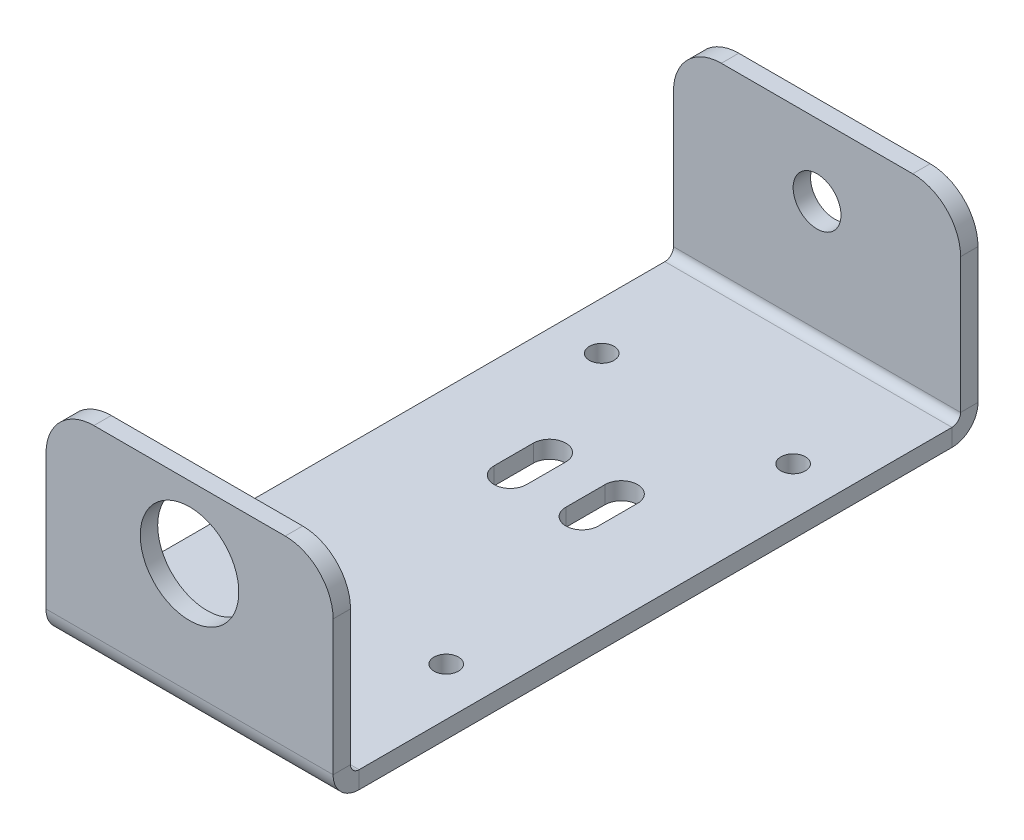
ISO-10303-21;
HEADER;
FILE_DESCRIPTION(('STEP AP214'),'2;1');
FILE_NAME('part.step','',(''),(''),'','','');
FILE_SCHEMA(('AUTOMOTIVE_DESIGN { 1 0 10303 214 1 1 1 1 }'));
ENDSEC;
DATA;
#1=APPLICATION_CONTEXT('core data for automotive mechanical design processes');
#2=APPLICATION_PROTOCOL_DEFINITION('international standard','automotive_design',2000,#1);
#3=PRODUCT_CONTEXT('',#1,'mechanical');
#4=PRODUCT('Part','Part','',(#3));
#5=PRODUCT_RELATED_PRODUCT_CATEGORY('part','',(#4));
#6=PRODUCT_DEFINITION_FORMATION('','',#4);
#7=PRODUCT_DEFINITION_CONTEXT('part definition',#1,'design');
#8=PRODUCT_DEFINITION('design','',#6,#7);
#9=PRODUCT_DEFINITION_SHAPE('','',#8);
#10=(LENGTH_UNIT() NAMED_UNIT(*) SI_UNIT(.MILLI.,.METRE.));
#11=(NAMED_UNIT(*) PLANE_ANGLE_UNIT() SI_UNIT($,.RADIAN.));
#12=(NAMED_UNIT(*) SI_UNIT($,.STERADIAN.) SOLID_ANGLE_UNIT());
#13=UNCERTAINTY_MEASURE_WITH_UNIT(LENGTH_MEASURE(1.E-05),#10,'distance_accuracy_value','');
#14=(GEOMETRIC_REPRESENTATION_CONTEXT(3) GLOBAL_UNCERTAINTY_ASSIGNED_CONTEXT((#13)) GLOBAL_UNIT_ASSIGNED_CONTEXT((#10,
#11,#12)) REPRESENTATION_CONTEXT('',''));
#15=CARTESIAN_POINT('',(0.,0.,0.));
#16=DIRECTION('',(0.,0.,1.));
#17=DIRECTION('',(1.,0.,0.));
#18=AXIS2_PLACEMENT_3D('',#15,#16,#17);
#19=CARTESIAN_POINT('',(19.05,1.143,-80.9625));
#20=DIRECTION('',(1.,0.,0.));
#21=DIRECTION('',(0.,0.,-1.));
#22=AXIS2_PLACEMENT_3D('',#19,#20,#21);
#23=PLANE('',#22);
#24=DIRECTION('',(0.,0.,-1.));
#25=VECTOR('',#24,1.);
#26=CARTESIAN_POINT('',(19.05,1.143,-80.9625));
#27=LINE('',#26,#25);
#28=CARTESIAN_POINT('',(19.05,1.143,-80.9625));
#29=VERTEX_POINT('',#28);
#30=CARTESIAN_POINT('',(19.05,1.143,-83.2739));
#31=VERTEX_POINT('',#30);
#32=EDGE_CURVE('E388',#29,#31,#27,.T.);
#33=ORIENTED_EDGE('',*,*,#32,.F.);
#34=CARTESIAN_POINT('',(19.05,1.143,-79.8195));
#35=DIRECTION('',(1.,0.,0.));
#36=DIRECTION('',(0.,0.,-1.));
#37=AXIS2_PLACEMENT_3D('',#34,#35,#36);
#38=CIRCLE('',#37,1.143);
#39=CARTESIAN_POINT('',(19.05,0.,-79.8195));
#40=VERTEX_POINT('',#39);
#41=EDGE_CURVE('E302',#29,#40,#38,.F.);
#42=ORIENTED_EDGE('',*,*,#41,.T.);
#43=DIRECTION('',(0.,1.,0.));
#44=VECTOR('',#43,1.);
#45=CARTESIAN_POINT('',(19.05,-2.3114,-79.8195));
#46=LINE('',#45,#44);
#47=CARTESIAN_POINT('',(19.05,-2.3114,-79.8195));
#48=VERTEX_POINT('',#47);
#49=EDGE_CURVE('E386',#48,#40,#46,.T.);
#50=ORIENTED_EDGE('',*,*,#49,.F.);
#51=CARTESIAN_POINT('',(19.05,1.143,-79.8195));
#52=DIRECTION('',(1.,0.,0.));
#53=DIRECTION('',(0.,0.,-1.));
#54=AXIS2_PLACEMENT_3D('',#51,#52,#53);
#55=CIRCLE('',#54,3.4544);
#56=EDGE_CURVE('E295',#31,#48,#55,.F.);
#57=ORIENTED_EDGE('',*,*,#56,.F.);
#58=EDGE_LOOP('',(#33,#42,#50,#57));
#59=FACE_BOUND('',#58,.T.);
#60=ADVANCED_FACE('F37',(#59),#23,.T.);
#61=CARTESIAN_POINT('',(19.05,-2.3114,-79.8195));
#62=DIRECTION('',(1.,0.,0.));
#63=DIRECTION('',(0.,0.,-1.));
#64=AXIS2_PLACEMENT_3D('',#61,#62,#63);
#65=PLANE('',#64);
#66=DIRECTION('',(0.,1.,0.));
#67=VECTOR('',#66,1.);
#68=CARTESIAN_POINT('',(19.05,0.,-83.2739));
#69=LINE('',#68,#67);
#70=CARTESIAN_POINT('',(19.05,19.05,-83.2739));
#71=VERTEX_POINT('',#70);
#72=EDGE_CURVE('E298',#71,#31,#69,.F.);
#73=ORIENTED_EDGE('',*,*,#72,.F.);
#74=DIRECTION('',(0.,0.,-1.));
#75=VECTOR('',#74,1.);
#76=CARTESIAN_POINT('',(19.05,19.05,-79.8195));
#77=LINE('',#76,#75);
#78=CARTESIAN_POINT('',(19.05,19.05,-80.9625));
#79=VERTEX_POINT('',#78);
#80=EDGE_CURVE('E400',#71,#79,#77,.F.);
#81=ORIENTED_EDGE('',*,*,#80,.T.);
#82=DIRECTION('',(0.,-1.,0.));
#83=VECTOR('',#82,1.);
#84=CARTESIAN_POINT('',(19.05,0.,-80.9625));
#85=LINE('',#84,#83);
#86=EDGE_CURVE('E300',#79,#29,#85,.T.);
#87=ORIENTED_EDGE('',*,*,#86,.T.);
#88=ORIENTED_EDGE('',*,*,#32,.T.);
#89=EDGE_LOOP('',(#73,#81,#87,#88));
#90=FACE_BOUND('',#89,.T.);
#91=ADVANCED_FACE('F507',(#90),#65,.T.);
#92=CARTESIAN_POINT('',(-19.05,0.,-79.8195));
#93=DIRECTION('',(-1.,0.,0.));
#94=DIRECTION('',(0.,0.,1.));
#95=AXIS2_PLACEMENT_3D('',#92,#93,#94);
#96=PLANE('',#95);
#97=DIRECTION('',(0.,-1.,0.));
#98=VECTOR('',#97,1.);
#99=CARTESIAN_POINT('',(-19.05,0.,-79.8195));
#100=LINE('',#99,#98);
#101=CARTESIAN_POINT('',(-19.05,0.,-79.8195));
#102=VERTEX_POINT('',#101);
#103=CARTESIAN_POINT('',(-19.05,-2.3114,-79.8195));
#104=VERTEX_POINT('',#103);
#105=EDGE_CURVE('E384',#102,#104,#100,.T.);
#106=ORIENTED_EDGE('',*,*,#105,.F.);
#107=CARTESIAN_POINT('',(-19.05,1.143,-79.8195));
#108=DIRECTION('',(1.,0.,0.));
#109=DIRECTION('',(0.,0.,-1.));
#110=AXIS2_PLACEMENT_3D('',#107,#108,#109);
#111=CIRCLE('',#110,1.143);
#112=CARTESIAN_POINT('',(-19.05,1.143,-80.9625));
#113=VERTEX_POINT('',#112);
#114=EDGE_CURVE('E330',#113,#102,#111,.F.);
#115=ORIENTED_EDGE('',*,*,#114,.F.);
#116=DIRECTION('',(0.,0.,1.));
#117=VECTOR('',#116,1.);
#118=CARTESIAN_POINT('',(-19.05,1.143,-83.2739));
#119=LINE('',#118,#117);
#120=CARTESIAN_POINT('',(-19.05,1.143,-83.2739));
#121=VERTEX_POINT('',#120);
#122=EDGE_CURVE('E381',#121,#113,#119,.T.);
#123=ORIENTED_EDGE('',*,*,#122,.F.);
#124=CARTESIAN_POINT('',(-19.05,1.143,-79.8195));
#125=DIRECTION('',(1.,0.,0.));
#126=DIRECTION('',(0.,0.,-1.));
#127=AXIS2_PLACEMENT_3D('',#124,#125,#126);
#128=CIRCLE('',#127,3.4544);
#129=EDGE_CURVE('E323',#121,#104,#128,.F.);
#130=ORIENTED_EDGE('',*,*,#129,.T.);
#131=EDGE_LOOP('',(#106,#115,#123,#130));
#132=FACE_BOUND('',#131,.T.);
#133=ADVANCED_FACE('F473',(#132),#96,.T.);
#134=CARTESIAN_POINT('',(-19.05,1.143,-83.2739));
#135=DIRECTION('',(-1.,0.,0.));
#136=DIRECTION('',(0.,0.,1.));
#137=AXIS2_PLACEMENT_3D('',#134,#135,#136);
#138=PLANE('',#137);
#139=DIRECTION('',(0.,0.,1.));
#140=VECTOR('',#139,1.);
#141=CARTESIAN_POINT('',(-19.05,0.,0.));
#142=LINE('',#141,#140);
#143=CARTESIAN_POINT('',(-19.05,0.,-1.143));
#144=VERTEX_POINT('',#143);
#145=EDGE_CURVE('E333',#102,#144,#142,.T.);
#146=ORIENTED_EDGE('',*,*,#145,.F.);
#147=ORIENTED_EDGE('',*,*,#105,.T.);
#148=DIRECTION('',(0.,0.,-1.));
#149=VECTOR('',#148,1.);
#150=CARTESIAN_POINT('',(-19.05,-2.3114,0.));
#151=LINE('',#150,#149);
#152=CARTESIAN_POINT('',(-19.05,-2.3114,-1.143));
#153=VERTEX_POINT('',#152);
#154=EDGE_CURVE('E320',#104,#153,#151,.F.);
#155=ORIENTED_EDGE('',*,*,#154,.T.);
#156=DIRECTION('',(0.,1.,0.));
#157=VECTOR('',#156,1.);
#158=CARTESIAN_POINT('',(-19.05,-2.3114,-1.143));
#159=LINE('',#158,#157);
#160=EDGE_CURVE('E373',#153,#144,#159,.T.);
#161=ORIENTED_EDGE('',*,*,#160,.T.);
#162=EDGE_LOOP('',(#146,#147,#155,#161));
#163=FACE_BOUND('',#162,.T.);
#164=ADVANCED_FACE('F466',(#163),#138,.T.);
#165=CARTESIAN_POINT('',(19.05,0.,-1.143));
#166=DIRECTION('',(1.,0.,0.));
#167=DIRECTION('',(0.,0.,-1.));
#168=AXIS2_PLACEMENT_3D('',#165,#166,#167);
#169=PLANE('',#168);
#170=DIRECTION('',(0.,-1.,0.));
#171=VECTOR('',#170,1.);
#172=CARTESIAN_POINT('',(19.05,0.,-1.143));
#173=LINE('',#172,#171);
#174=CARTESIAN_POINT('',(19.05,0.,-1.143));
#175=VERTEX_POINT('',#174);
#176=CARTESIAN_POINT('',(19.05,-2.3114,-1.143));
#177=VERTEX_POINT('',#176);
#178=EDGE_CURVE('E379',#175,#177,#173,.T.);
#179=ORIENTED_EDGE('',*,*,#178,.F.);
#180=CARTESIAN_POINT('',(19.05,1.143,-1.143));
#181=DIRECTION('',(1.,0.,0.));
#182=DIRECTION('',(0.,0.,-1.));
#183=AXIS2_PLACEMENT_3D('',#180,#181,#182);
#184=CIRCLE('',#183,1.143);
#185=CARTESIAN_POINT('',(19.05,1.143,0.));
#186=VERTEX_POINT('',#185);
#187=EDGE_CURVE('E308',#175,#186,#184,.F.);
#188=ORIENTED_EDGE('',*,*,#187,.T.);
#189=DIRECTION('',(0.,0.,-1.));
#190=VECTOR('',#189,1.);
#191=CARTESIAN_POINT('',(19.05,1.143,2.3114));
#192=LINE('',#191,#190);
#193=CARTESIAN_POINT('',(19.05,1.143,2.3114));
#194=VERTEX_POINT('',#193);
#195=EDGE_CURVE('E377',#194,#186,#192,.T.);
#196=ORIENTED_EDGE('',*,*,#195,.F.);
#197=CARTESIAN_POINT('',(19.05,1.143,-1.143));
#198=DIRECTION('',(1.,0.,0.));
#199=DIRECTION('',(0.,0.,-1.));
#200=AXIS2_PLACEMENT_3D('',#197,#198,#199);
#201=CIRCLE('',#200,3.4544);
#202=EDGE_CURVE('E289',#177,#194,#201,.F.);
#203=ORIENTED_EDGE('',*,*,#202,.F.);
#204=EDGE_LOOP('',(#179,#188,#196,#203));
#205=FACE_BOUND('',#204,.T.);
#206=ADVANCED_FACE('F452',(#205),#169,.T.);
#207=CARTESIAN_POINT('',(19.05,1.143,2.3114));
#208=DIRECTION('',(1.,0.,0.));
#209=DIRECTION('',(0.,0.,-1.));
#210=AXIS2_PLACEMENT_3D('',#207,#208,#209);
#211=PLANE('',#210);
#212=DIRECTION('',(0.,0.,1.));
#213=VECTOR('',#212,1.);
#214=CARTESIAN_POINT('',(19.05,0.,0.));
#215=LINE('',#214,#213);
#216=EDGE_CURVE('E305',#40,#175,#215,.T.);
#217=ORIENTED_EDGE('',*,*,#216,.T.);
#218=ORIENTED_EDGE('',*,*,#178,.T.);
#219=DIRECTION('',(0.,0.,-1.));
#220=VECTOR('',#219,1.);
#221=CARTESIAN_POINT('',(19.05,-2.3114,0.));
#222=LINE('',#221,#220);
#223=EDGE_CURVE('E292',#48,#177,#222,.F.);
#224=ORIENTED_EDGE('',*,*,#223,.F.);
#225=ORIENTED_EDGE('',*,*,#49,.T.);
#226=EDGE_LOOP('',(#217,#218,#224,#225));
#227=FACE_BOUND('',#226,.T.);
#228=ADVANCED_FACE('F485',(#227),#211,.T.);
#229=CARTESIAN_POINT('',(-19.05,1.143,0.));
#230=DIRECTION('',(-1.,0.,0.));
#231=DIRECTION('',(0.,0.,1.));
#232=AXIS2_PLACEMENT_3D('',#229,#230,#231);
#233=PLANE('',#232);
#234=DIRECTION('',(0.,0.,1.));
#235=VECTOR('',#234,1.);
#236=CARTESIAN_POINT('',(-19.05,1.143,0.));
#237=LINE('',#236,#235);
#238=CARTESIAN_POINT('',(-19.05,1.143,0.));
#239=VERTEX_POINT('',#238);
#240=CARTESIAN_POINT('',(-19.05,1.143,2.3114));
#241=VERTEX_POINT('',#240);
#242=EDGE_CURVE('E375',#239,#241,#237,.T.);
#243=ORIENTED_EDGE('',*,*,#242,.F.);
#244=CARTESIAN_POINT('',(-19.05,1.143,-1.143));
#245=DIRECTION('',(1.,0.,0.));
#246=DIRECTION('',(0.,0.,-1.));
#247=AXIS2_PLACEMENT_3D('',#244,#245,#246);
#248=CIRCLE('',#247,1.143);
#249=EDGE_CURVE('E286',#144,#239,#248,.F.);
#250=ORIENTED_EDGE('',*,*,#249,.F.);
#251=ORIENTED_EDGE('',*,*,#160,.F.);
#252=CARTESIAN_POINT('',(-19.05,1.143,-1.143));
#253=DIRECTION('',(1.,0.,0.));
#254=DIRECTION('',(0.,0.,-1.));
#255=AXIS2_PLACEMENT_3D('',#252,#253,#254);
#256=CIRCLE('',#255,3.4544);
#257=EDGE_CURVE('E317',#153,#241,#256,.F.);
#258=ORIENTED_EDGE('',*,*,#257,.T.);
#259=EDGE_LOOP('',(#243,#250,#251,#258));
#260=FACE_BOUND('',#259,.T.);
#261=ADVANCED_FACE('F458',(#260),#233,.T.);
#262=CARTESIAN_POINT('',(-19.05,-2.3114,-1.143));
#263=DIRECTION('',(-1.,0.,0.));
#264=DIRECTION('',(0.,0.,1.));
#265=AXIS2_PLACEMENT_3D('',#262,#263,#264);
#266=PLANE('',#265);
#267=DIRECTION('',(0.,1.,0.));
#268=VECTOR('',#267,1.);
#269=CARTESIAN_POINT('',(-19.05,0.,2.3114));
#270=LINE('',#269,#268);
#271=CARTESIAN_POINT('',(-19.05,19.05,2.3114));
#272=VERTEX_POINT('',#271);
#273=EDGE_CURVE('E314',#241,#272,#270,.T.);
#274=ORIENTED_EDGE('',*,*,#273,.T.);
#275=DIRECTION('',(0.,0.,-1.));
#276=VECTOR('',#275,1.);
#277=CARTESIAN_POINT('',(-19.05,19.05,-1.143));
#278=LINE('',#277,#276);
#279=CARTESIAN_POINT('',(-19.05,19.05,0.));
#280=VERTEX_POINT('',#279);
#281=EDGE_CURVE('E409',#272,#280,#278,.T.);
#282=ORIENTED_EDGE('',*,*,#281,.T.);
#283=DIRECTION('',(0.,1.,0.));
#284=VECTOR('',#283,1.);
#285=CARTESIAN_POINT('',(-19.05,0.,0.));
#286=LINE('',#285,#284);
#287=EDGE_CURVE('E279',#239,#280,#286,.T.);
#288=ORIENTED_EDGE('',*,*,#287,.F.);
#289=ORIENTED_EDGE('',*,*,#242,.T.);
#290=EDGE_LOOP('',(#274,#282,#288,#289));
#291=FACE_BOUND('',#290,.T.);
#292=ADVANCED_FACE('F432',(#291),#266,.T.);
#293=CARTESIAN_POINT('',(19.05,0.,0.));
#294=DIRECTION('',(0.,0.,1.));
#295=DIRECTION('',(1.,0.,0.));
#296=AXIS2_PLACEMENT_3D('',#293,#294,#295);
#297=PLANE('',#296);
#298=CARTESIAN_POINT('',(0.,15.875,0.));
#299=DIRECTION('',(0.,0.,-1.));
#300=DIRECTION('',(-1.,0.,0.));
#301=AXIS2_PLACEMENT_3D('',#298,#299,#300);
#302=CIRCLE('',#301,6.5405);
#303=CARTESIAN_POINT('',(-6.5405,15.875,0.));
#304=VERTEX_POINT('',#303);
#305=EDGE_CURVE('E263',#304,#304,#302,.T.);
#306=ORIENTED_EDGE('',*,*,#305,.F.);
#307=EDGE_LOOP('',(#306));
#308=FACE_BOUND('',#307,.T.);
#309=ORIENTED_EDGE('',*,*,#287,.T.);
#310=CARTESIAN_POINT('',(-12.7,19.05,0.));
#311=DIRECTION('',(0.,0.,1.));
#312=DIRECTION('',(1.,0.,0.));
#313=AXIS2_PLACEMENT_3D('',#310,#311,#312);
#314=CIRCLE('',#313,6.35);
#315=CARTESIAN_POINT('',(-12.7,25.4,0.));
#316=VERTEX_POINT('',#315);
#317=EDGE_CURVE('E414',#280,#316,#314,.F.);
#318=ORIENTED_EDGE('',*,*,#317,.T.);
#319=DIRECTION('',(-1.,0.,0.));
#320=VECTOR('',#319,1.);
#321=CARTESIAN_POINT('',(19.05,25.4,0.));
#322=LINE('',#321,#320);
#323=CARTESIAN_POINT('',(12.7,25.4,0.));
#324=VERTEX_POINT('',#323);
#325=EDGE_CURVE('E370',#324,#316,#322,.T.);
#326=ORIENTED_EDGE('',*,*,#325,.F.);
#327=CARTESIAN_POINT('',(12.7,19.05,0.));
#328=DIRECTION('',(0.,0.,1.));
#329=DIRECTION('',(1.,0.,0.));
#330=AXIS2_PLACEMENT_3D('',#327,#328,#329);
#331=CIRCLE('',#330,6.35);
#332=CARTESIAN_POINT('',(19.05,19.05,0.));
#333=VERTEX_POINT('',#332);
#334=EDGE_CURVE('E412',#324,#333,#331,.F.);
#335=ORIENTED_EDGE('',*,*,#334,.T.);
#336=DIRECTION('',(0.,1.,0.));
#337=VECTOR('',#336,1.);
#338=CARTESIAN_POINT('',(19.05,0.,0.));
#339=LINE('',#338,#337);
#340=EDGE_CURVE('E282',#186,#333,#339,.T.);
#341=ORIENTED_EDGE('',*,*,#340,.F.);
#342=DIRECTION('',(-1.,0.,0.));
#343=VECTOR('',#342,1.);
#344=CARTESIAN_POINT('',(19.05,1.143,0.));
#345=LINE('',#344,#343);
#346=EDGE_CURVE('E311',#186,#239,#345,.T.);
#347=ORIENTED_EDGE('',*,*,#346,.T.);
#348=EDGE_LOOP('',(#309,#318,#326,#335,#341,#347));
#349=FACE_BOUND('',#348,.T.);
#350=ADVANCED_FACE('F437',(#308,#349),#297,.F.);
#351=CARTESIAN_POINT('',(19.05,25.4,2.3114));
#352=DIRECTION('',(0.,1.,0.));
#353=DIRECTION('',(0.,0.,1.));
#354=AXIS2_PLACEMENT_3D('',#351,#352,#353);
#355=PLANE('',#354);
#356=ORIENTED_EDGE('',*,*,#325,.T.);
#357=DIRECTION('',(0.,0.,-1.));
#358=VECTOR('',#357,1.);
#359=CARTESIAN_POINT('',(-12.7,25.4,2.3114));
#360=LINE('',#359,#358);
#361=CARTESIAN_POINT('',(-12.7,25.4,2.3114));
#362=VERTEX_POINT('',#361);
#363=EDGE_CURVE('E419',#316,#362,#360,.F.);
#364=ORIENTED_EDGE('',*,*,#363,.T.);
#365=DIRECTION('',(-1.,0.,0.));
#366=VECTOR('',#365,1.);
#367=CARTESIAN_POINT('',(19.05,25.4,2.3114));
#368=LINE('',#367,#366);
#369=CARTESIAN_POINT('',(12.7,25.4,2.3114));
#370=VERTEX_POINT('',#369);
#371=EDGE_CURVE('E367',#370,#362,#368,.T.);
#372=ORIENTED_EDGE('',*,*,#371,.F.);
#373=DIRECTION('',(0.,0.,-1.));
#374=VECTOR('',#373,1.);
#375=CARTESIAN_POINT('',(12.7,25.4,2.3114));
#376=LINE('',#375,#374);
#377=EDGE_CURVE('E416',#370,#324,#376,.T.);
#378=ORIENTED_EDGE('',*,*,#377,.T.);
#379=EDGE_LOOP('',(#356,#364,#372,#378));
#380=FACE_BOUND('',#379,.T.);
#381=ADVANCED_FACE('F439',(#380),#355,.T.);
#382=CARTESIAN_POINT('',(19.05,0.,2.3114));
#383=DIRECTION('',(0.,0.,1.));
#384=DIRECTION('',(1.,0.,0.));
#385=AXIS2_PLACEMENT_3D('',#382,#383,#384);
#386=PLANE('',#385);
#387=CARTESIAN_POINT('',(0.,15.875,2.3114));
#388=DIRECTION('',(0.,0.,-1.));
#389=DIRECTION('',(-1.,0.,0.));
#390=AXIS2_PLACEMENT_3D('',#387,#388,#389);
#391=CIRCLE('',#390,6.5405);
#392=CARTESIAN_POINT('',(-6.5405,15.875,2.3114));
#393=VERTEX_POINT('',#392);
#394=EDGE_CURVE('E270',#393,#393,#391,.T.);
#395=ORIENTED_EDGE('',*,*,#394,.T.);
#396=EDGE_LOOP('',(#395));
#397=FACE_BOUND('',#396,.T.);
#398=ORIENTED_EDGE('',*,*,#371,.T.);
#399=CARTESIAN_POINT('',(-12.7,19.05,2.3114));
#400=DIRECTION('',(0.,0.,1.));
#401=DIRECTION('',(1.,0.,0.));
#402=AXIS2_PLACEMENT_3D('',#399,#400,#401);
#403=CIRCLE('',#402,6.35);
#404=EDGE_CURVE('E45',#362,#272,#403,.T.);
#405=ORIENTED_EDGE('',*,*,#404,.T.);
#406=ORIENTED_EDGE('',*,*,#273,.F.);
#407=DIRECTION('',(-1.,0.,0.));
#408=VECTOR('',#407,1.);
#409=CARTESIAN_POINT('',(19.05,1.143,2.3114));
#410=LINE('',#409,#408);
#411=EDGE_CURVE('E364',#194,#241,#410,.T.);
#412=ORIENTED_EDGE('',*,*,#411,.F.);
#413=DIRECTION('',(0.,1.,0.));
#414=VECTOR('',#413,1.);
#415=CARTESIAN_POINT('',(19.05,0.,2.3114));
#416=LINE('',#415,#414);
#417=CARTESIAN_POINT('',(19.05,19.05,2.3114));
#418=VERTEX_POINT('',#417);
#419=EDGE_CURVE('E285',#194,#418,#416,.T.);
#420=ORIENTED_EDGE('',*,*,#419,.T.);
#421=CARTESIAN_POINT('',(12.7,19.05,2.3114));
#422=DIRECTION('',(0.,0.,1.));
#423=DIRECTION('',(1.,0.,0.));
#424=AXIS2_PLACEMENT_3D('',#421,#422,#423);
#425=CIRCLE('',#424,6.35);
#426=EDGE_CURVE('E421',#418,#370,#425,.T.);
#427=ORIENTED_EDGE('',*,*,#426,.T.);
#428=EDGE_LOOP('',(#398,#405,#406,#412,#420,#427));
#429=FACE_BOUND('',#428,.T.);
#430=ADVANCED_FACE('F425',(#397,#429),#386,.T.);
#431=CARTESIAN_POINT('',(19.05,1.143,-1.143));
#432=DIRECTION('',(-1.,0.,0.));
#433=DIRECTION('',(0.,0.,1.));
#434=AXIS2_PLACEMENT_3D('',#431,#432,#433);
#435=CYLINDRICAL_SURFACE('',#434,3.4544);
#436=ORIENTED_EDGE('',*,*,#257,.F.);
#437=DIRECTION('',(-1.,0.,0.));
#438=VECTOR('',#437,1.);
#439=CARTESIAN_POINT('',(19.05,-2.3114,-1.143));
#440=LINE('',#439,#438);
#441=EDGE_CURVE('E361',#177,#153,#440,.T.);
#442=ORIENTED_EDGE('',*,*,#441,.F.);
#443=ORIENTED_EDGE('',*,*,#202,.T.);
#444=ORIENTED_EDGE('',*,*,#411,.T.);
#445=EDGE_LOOP('',(#436,#442,#443,#444));
#446=FACE_BOUND('',#445,.T.);
#447=ADVANCED_FACE('F462',(#446),#435,.T.);
#448=CARTESIAN_POINT('',(19.05,-2.3114,0.));
#449=DIRECTION('',(0.,-1.,0.));
#450=DIRECTION('',(0.,0.,-1.));
#451=AXIS2_PLACEMENT_3D('',#448,#449,#450);
#452=PLANE('',#451);
#453=CARTESIAN_POINT('',(12.7,-2.3114,-19.05));
#454=DIRECTION('',(0.,1.,0.));
#455=DIRECTION('',(0.,0.,1.));
#456=AXIS2_PLACEMENT_3D('',#453,#454,#455);
#457=CIRCLE('',#456,1.6256);
#458=CARTESIAN_POINT('',(12.7,-2.3114,-17.4244));
#459=VERTEX_POINT('',#458);
#460=EDGE_CURVE('E632',#459,#459,#457,.T.);
#461=ORIENTED_EDGE('',*,*,#460,.T.);
#462=EDGE_LOOP('',(#461));
#463=FACE_BOUND('',#462,.T.);
#464=CARTESIAN_POINT('',(-12.7,-2.3114,-19.05));
#465=DIRECTION('',(0.,1.,0.));
#466=DIRECTION('',(0.,0.,1.));
#467=AXIS2_PLACEMENT_3D('',#464,#465,#466);
#468=CIRCLE('',#467,1.6256);
#469=CARTESIAN_POINT('',(-12.7,-2.3114,-17.4244));
#470=VERTEX_POINT('',#469);
#471=EDGE_CURVE('E640',#470,#470,#468,.T.);
#472=ORIENTED_EDGE('',*,*,#471,.T.);
#473=EDGE_LOOP('',(#472));
#474=FACE_BOUND('',#473,.T.);
#475=CARTESIAN_POINT('',(-12.7,-2.3114,-65.0875));
#476=DIRECTION('',(0.,1.,0.));
#477=DIRECTION('',(0.,0.,1.));
#478=AXIS2_PLACEMENT_3D('',#475,#476,#477);
#479=CIRCLE('',#478,1.6256);
#480=CARTESIAN_POINT('',(-12.7,-2.3114,-63.4619));
#481=VERTEX_POINT('',#480);
#482=EDGE_CURVE('E646',#481,#481,#479,.T.);
#483=ORIENTED_EDGE('',*,*,#482,.T.);
#484=EDGE_LOOP('',(#483));
#485=FACE_BOUND('',#484,.T.);
#486=CARTESIAN_POINT('',(12.7,-2.3114,-65.0875));
#487=DIRECTION('',(0.,1.,0.));
#488=DIRECTION('',(0.,0.,1.));
#489=AXIS2_PLACEMENT_3D('',#486,#487,#488);
#490=CIRCLE('',#489,1.6256);
#491=CARTESIAN_POINT('',(12.7,-2.3114,-63.4619));
#492=VERTEX_POINT('',#491);
#493=EDGE_CURVE('E228',#492,#492,#490,.T.);
#494=ORIENTED_EDGE('',*,*,#493,.T.);
#495=EDGE_LOOP('',(#494));
#496=FACE_BOUND('',#495,.T.);
#497=CARTESIAN_POINT('',(4.7625,-2.3114,-45.0215));
#498=DIRECTION('',(0.,1.,0.));
#499=DIRECTION('',(0.,0.,-1.));
#500=AXIS2_PLACEMENT_3D('',#497,#498,#499);
#501=CIRCLE('',#500,2.159);
#502=CARTESIAN_POINT('',(2.6035,-2.3114,-45.0215));
#503=VERTEX_POINT('',#502);
#504=CARTESIAN_POINT('',(6.9215,-2.3114,-45.0215));
#505=VERTEX_POINT('',#504);
#506=EDGE_CURVE('E199',#503,#505,#501,.T.);
#507=ORIENTED_EDGE('',*,*,#506,.T.);
#508=DIRECTION('',(0.,0.,-1.));
#509=VECTOR('',#508,1.);
#510=CARTESIAN_POINT('',(6.9215,-2.3114,-45.0215));
#511=LINE('',#510,#509);
#512=CARTESIAN_POINT('',(6.9215,-2.3114,-50.2285));
#513=VERTEX_POINT('',#512);
#514=EDGE_CURVE('E208',#505,#513,#511,.T.);
#515=ORIENTED_EDGE('',*,*,#514,.T.);
#516=CARTESIAN_POINT('',(4.7625,-2.3114,-50.2285));
#517=DIRECTION('',(0.,1.,0.));
#518=DIRECTION('',(0.,0.,-1.));
#519=AXIS2_PLACEMENT_3D('',#516,#517,#518);
#520=CIRCLE('',#519,2.159);
#521=CARTESIAN_POINT('',(2.6035,-2.3114,-50.2285));
#522=VERTEX_POINT('',#521);
#523=EDGE_CURVE('E52',#513,#522,#520,.T.);
#524=ORIENTED_EDGE('',*,*,#523,.T.);
#525=DIRECTION('',(0.,0.,1.));
#526=VECTOR('',#525,1.);
#527=CARTESIAN_POINT('',(2.6035,-2.3114,-45.0215));
#528=LINE('',#527,#526);
#529=EDGE_CURVE('E205',#522,#503,#528,.T.);
#530=ORIENTED_EDGE('',*,*,#529,.T.);
#531=EDGE_LOOP('',(#507,#515,#524,#530));
#532=FACE_BOUND('',#531,.T.);
#533=CARTESIAN_POINT('',(-4.7625,-2.3114,-45.0215));
#534=DIRECTION('',(0.,1.,0.));
#535=DIRECTION('',(0.,0.,1.));
#536=AXIS2_PLACEMENT_3D('',#533,#534,#535);
#537=CIRCLE('',#536,2.159);
#538=CARTESIAN_POINT('',(-6.9215,-2.3114,-45.0215));
#539=VERTEX_POINT('',#538);
#540=CARTESIAN_POINT('',(-2.6035,-2.3114,-45.0215));
#541=VERTEX_POINT('',#540);
#542=EDGE_CURVE('E238',#539,#541,#537,.T.);
#543=ORIENTED_EDGE('',*,*,#542,.T.);
#544=DIRECTION('',(0.,0.,-1.));
#545=VECTOR('',#544,1.);
#546=CARTESIAN_POINT('',(-2.6035,-2.3114,-45.0215));
#547=LINE('',#546,#545);
#548=CARTESIAN_POINT('',(-2.6035,-2.3114,-50.2285));
#549=VERTEX_POINT('',#548);
#550=EDGE_CURVE('E241',#541,#549,#547,.T.);
#551=ORIENTED_EDGE('',*,*,#550,.T.);
#552=CARTESIAN_POINT('',(-4.7625,-2.3114,-50.2285));
#553=DIRECTION('',(0.,1.,0.));
#554=DIRECTION('',(0.,0.,1.));
#555=AXIS2_PLACEMENT_3D('',#552,#553,#554);
#556=CIRCLE('',#555,2.159);
#557=CARTESIAN_POINT('',(-6.9215,-2.3114,-50.2285));
#558=VERTEX_POINT('',#557);
#559=EDGE_CURVE('E245',#549,#558,#556,.T.);
#560=ORIENTED_EDGE('',*,*,#559,.T.);
#561=DIRECTION('',(0.,0.,1.));
#562=VECTOR('',#561,1.);
#563=CARTESIAN_POINT('',(-6.9215,-2.3114,-45.0215));
#564=LINE('',#563,#562);
#565=EDGE_CURVE('E248',#558,#539,#564,.T.);
#566=ORIENTED_EDGE('',*,*,#565,.T.);
#567=EDGE_LOOP('',(#543,#551,#560,#566));
#568=FACE_BOUND('',#567,.T.);
#569=ORIENTED_EDGE('',*,*,#154,.F.);
#570=DIRECTION('',(-1.,0.,0.));
#571=VECTOR('',#570,1.);
#572=CARTESIAN_POINT('',(19.05,-2.3114,-79.8195));
#573=LINE('',#572,#571);
#574=EDGE_CURVE('E358',#48,#104,#573,.T.);
#575=ORIENTED_EDGE('',*,*,#574,.F.);
#576=ORIENTED_EDGE('',*,*,#223,.T.);
#577=ORIENTED_EDGE('',*,*,#441,.T.);
#578=EDGE_LOOP('',(#569,#575,#576,#577));
#579=FACE_BOUND('',#578,.T.);
#580=ADVANCED_FACE('F212',(#463,#474,#485,#496,#532,#568,#579),#452,.T.);
#581=CARTESIAN_POINT('',(19.05,1.143,-79.8195));
#582=DIRECTION('',(-1.,0.,0.));
#583=DIRECTION('',(0.,0.,1.));
#584=AXIS2_PLACEMENT_3D('',#581,#582,#583);
#585=CYLINDRICAL_SURFACE('',#584,3.4544);
#586=ORIENTED_EDGE('',*,*,#129,.F.);
#587=DIRECTION('',(-1.,0.,0.));
#588=VECTOR('',#587,1.);
#589=CARTESIAN_POINT('',(19.05,1.143,-83.2739));
#590=LINE('',#589,#588);
#591=EDGE_CURVE('E355',#31,#121,#590,.T.);
#592=ORIENTED_EDGE('',*,*,#591,.F.);
#593=ORIENTED_EDGE('',*,*,#56,.T.);
#594=ORIENTED_EDGE('',*,*,#574,.T.);
#595=EDGE_LOOP('',(#586,#592,#593,#594));
#596=FACE_BOUND('',#595,.T.);
#597=ADVANCED_FACE('F477',(#596),#585,.T.);
#598=CARTESIAN_POINT('',(19.05,0.,-83.2739));
#599=DIRECTION('',(0.,0.,-1.));
#600=DIRECTION('',(-1.,0.,0.));
#601=AXIS2_PLACEMENT_3D('',#598,#599,#600);
#602=PLANE('',#601);
#603=CARTESIAN_POINT('',(0.,15.875,-83.2739));
#604=DIRECTION('',(0.,0.,1.));
#605=DIRECTION('',(1.,0.,0.));
#606=AXIS2_PLACEMENT_3D('',#603,#604,#605);
#607=CIRCLE('',#606,3.175);
#608=CARTESIAN_POINT('',(3.175,15.875,-83.2739));
#609=VERTEX_POINT('',#608);
#610=EDGE_CURVE('E276',#609,#609,#607,.T.);
#611=ORIENTED_EDGE('',*,*,#610,.T.);
#612=EDGE_LOOP('',(#611));
#613=FACE_BOUND('',#612,.T.);
#614=DIRECTION('',(-1.,0.,0.));
#615=VECTOR('',#614,1.);
#616=CARTESIAN_POINT('',(19.05,25.4,-83.2739));
#617=LINE('',#616,#615);
#618=CARTESIAN_POINT('',(12.7,25.4,-83.2739));
#619=VERTEX_POINT('',#618);
#620=CARTESIAN_POINT('',(-12.7,25.4,-83.2739));
#621=VERTEX_POINT('',#620);
#622=EDGE_CURVE('E352',#619,#621,#617,.T.);
#623=ORIENTED_EDGE('',*,*,#622,.F.);
#624=CARTESIAN_POINT('',(12.7,19.05,-83.2739));
#625=DIRECTION('',(0.,0.,-1.));
#626=DIRECTION('',(-1.,0.,0.));
#627=AXIS2_PLACEMENT_3D('',#624,#625,#626);
#628=CIRCLE('',#627,6.35);
#629=EDGE_CURVE('E398',#619,#71,#628,.T.);
#630=ORIENTED_EDGE('',*,*,#629,.T.);
#631=ORIENTED_EDGE('',*,*,#72,.T.);
#632=ORIENTED_EDGE('',*,*,#591,.T.);
#633=DIRECTION('',(0.,1.,0.));
#634=VECTOR('',#633,1.);
#635=CARTESIAN_POINT('',(-19.05,0.,-83.2739));
#636=LINE('',#635,#634);
#637=CARTESIAN_POINT('',(-19.05,19.05,-83.2739));
#638=VERTEX_POINT('',#637);
#639=EDGE_CURVE('E326',#638,#121,#636,.F.);
#640=ORIENTED_EDGE('',*,*,#639,.F.);
#641=CARTESIAN_POINT('',(-12.7,19.05,-83.2739));
#642=DIRECTION('',(0.,0.,-1.));
#643=DIRECTION('',(-1.,0.,0.));
#644=AXIS2_PLACEMENT_3D('',#641,#642,#643);
#645=CIRCLE('',#644,6.35);
#646=EDGE_CURVE('E396',#638,#621,#645,.T.);
#647=ORIENTED_EDGE('',*,*,#646,.T.);
#648=EDGE_LOOP('',(#623,#630,#631,#632,#640,#647));
#649=FACE_BOUND('',#648,.T.);
#650=ADVANCED_FACE('F503',(#613,#649),#602,.T.);
#651=CARTESIAN_POINT('',(19.05,25.4,-80.9625));
#652=DIRECTION('',(0.,1.,0.));
#653=DIRECTION('',(0.,0.,1.));
#654=AXIS2_PLACEMENT_3D('',#651,#652,#653);
#655=PLANE('',#654);
#656=DIRECTION('',(-1.,0.,0.));
#657=VECTOR('',#656,1.);
#658=CARTESIAN_POINT('',(19.05,25.4,-80.9625));
#659=LINE('',#658,#657);
#660=CARTESIAN_POINT('',(12.7,25.4,-80.9625));
#661=VERTEX_POINT('',#660);
#662=CARTESIAN_POINT('',(-12.7,25.4,-80.9625));
#663=VERTEX_POINT('',#662);
#664=EDGE_CURVE('E349',#661,#663,#659,.T.);
#665=ORIENTED_EDGE('',*,*,#664,.F.);
#666=DIRECTION('',(0.,0.,-1.));
#667=VECTOR('',#666,1.);
#668=CARTESIAN_POINT('',(12.7,25.4,-80.9625));
#669=LINE('',#668,#667);
#670=EDGE_CURVE('E393',#661,#619,#669,.T.);
#671=ORIENTED_EDGE('',*,*,#670,.T.);
#672=ORIENTED_EDGE('',*,*,#622,.T.);
#673=DIRECTION('',(0.,0.,-1.));
#674=VECTOR('',#673,1.);
#675=CARTESIAN_POINT('',(-12.7,25.4,-80.9625));
#676=LINE('',#675,#674);
#677=EDGE_CURVE('E391',#621,#663,#676,.F.);
#678=ORIENTED_EDGE('',*,*,#677,.T.);
#679=EDGE_LOOP('',(#665,#671,#672,#678));
#680=FACE_BOUND('',#679,.T.);
#681=ADVANCED_FACE('F513',(#680),#655,.T.);
#682=CARTESIAN_POINT('',(19.05,0.,-80.9625));
#683=DIRECTION('',(0.,0.,-1.));
#684=DIRECTION('',(-1.,0.,0.));
#685=AXIS2_PLACEMENT_3D('',#682,#683,#684);
#686=PLANE('',#685);
#687=CARTESIAN_POINT('',(0.,15.875,-80.9625));
#688=DIRECTION('',(0.,0.,1.));
#689=DIRECTION('',(1.,0.,0.));
#690=AXIS2_PLACEMENT_3D('',#687,#688,#689);
#691=CIRCLE('',#690,3.175);
#692=CARTESIAN_POINT('',(3.175,15.875,-80.9625));
#693=VERTEX_POINT('',#692);
#694=EDGE_CURVE('E273',#693,#693,#691,.T.);
#695=ORIENTED_EDGE('',*,*,#694,.F.);
#696=EDGE_LOOP('',(#695));
#697=FACE_BOUND('',#696,.T.);
#698=ORIENTED_EDGE('',*,*,#86,.F.);
#699=CARTESIAN_POINT('',(12.7,19.05,-80.9625));
#700=DIRECTION('',(0.,0.,-1.));
#701=DIRECTION('',(-1.,0.,0.));
#702=AXIS2_PLACEMENT_3D('',#699,#700,#701);
#703=CIRCLE('',#702,6.35);
#704=EDGE_CURVE('E404',#79,#661,#703,.F.);
#705=ORIENTED_EDGE('',*,*,#704,.T.);
#706=ORIENTED_EDGE('',*,*,#664,.T.);
#707=CARTESIAN_POINT('',(-12.7,19.05,-80.9625));
#708=DIRECTION('',(0.,0.,-1.));
#709=DIRECTION('',(-1.,0.,0.));
#710=AXIS2_PLACEMENT_3D('',#707,#708,#709);
#711=CIRCLE('',#710,6.35);
#712=CARTESIAN_POINT('',(-19.05,19.05,-80.9625));
#713=VERTEX_POINT('',#712);
#714=EDGE_CURVE('E402',#663,#713,#711,.F.);
#715=ORIENTED_EDGE('',*,*,#714,.T.);
#716=DIRECTION('',(0.,-1.,0.));
#717=VECTOR('',#716,1.);
#718=CARTESIAN_POINT('',(-19.05,0.,-80.9625));
#719=LINE('',#718,#717);
#720=EDGE_CURVE('E328',#713,#113,#719,.T.);
#721=ORIENTED_EDGE('',*,*,#720,.T.);
#722=DIRECTION('',(-1.,0.,0.));
#723=VECTOR('',#722,1.);
#724=CARTESIAN_POINT('',(19.05,1.143,-80.9625));
#725=LINE('',#724,#723);
#726=EDGE_CURVE('E346',#29,#113,#725,.T.);
#727=ORIENTED_EDGE('',*,*,#726,.F.);
#728=EDGE_LOOP('',(#698,#705,#706,#715,#721,#727));
#729=FACE_BOUND('',#728,.T.);
#730=ADVANCED_FACE('F493',(#697,#729),#686,.F.);
#731=CARTESIAN_POINT('',(19.05,1.143,-79.8195));
#732=DIRECTION('',(-1.,0.,0.));
#733=DIRECTION('',(0.,0.,1.));
#734=AXIS2_PLACEMENT_3D('',#731,#732,#733);
#735=CYLINDRICAL_SURFACE('',#734,1.143);
#736=ORIENTED_EDGE('',*,*,#114,.T.);
#737=DIRECTION('',(-1.,0.,0.));
#738=VECTOR('',#737,1.);
#739=CARTESIAN_POINT('',(19.05,0.,-79.8195));
#740=LINE('',#739,#738);
#741=EDGE_CURVE('E343',#40,#102,#740,.T.);
#742=ORIENTED_EDGE('',*,*,#741,.F.);
#743=ORIENTED_EDGE('',*,*,#41,.F.);
#744=ORIENTED_EDGE('',*,*,#726,.T.);
#745=EDGE_LOOP('',(#736,#742,#743,#744));
#746=FACE_BOUND('',#745,.T.);
#747=ADVANCED_FACE('F490',(#746),#735,.F.);
#748=CARTESIAN_POINT('',(19.05,0.,0.));
#749=DIRECTION('',(0.,-1.,0.));
#750=DIRECTION('',(0.,0.,-1.));
#751=AXIS2_PLACEMENT_3D('',#748,#749,#750);
#752=PLANE('',#751);
#753=CARTESIAN_POINT('',(12.7,0.,-19.05));
#754=DIRECTION('',(0.,1.,0.));
#755=DIRECTION('',(0.,0.,1.));
#756=AXIS2_PLACEMENT_3D('',#753,#754,#755);
#757=CIRCLE('',#756,1.6256);
#758=CARTESIAN_POINT('',(12.7,0.,-17.4244));
#759=VERTEX_POINT('',#758);
#760=EDGE_CURVE('E635',#759,#759,#757,.T.);
#761=ORIENTED_EDGE('',*,*,#760,.F.);
#762=EDGE_LOOP('',(#761));
#763=FACE_BOUND('',#762,.T.);
#764=CARTESIAN_POINT('',(-12.7,0.,-19.05));
#765=DIRECTION('',(0.,1.,0.));
#766=DIRECTION('',(0.,0.,1.));
#767=AXIS2_PLACEMENT_3D('',#764,#765,#766);
#768=CIRCLE('',#767,1.6256);
#769=CARTESIAN_POINT('',(-12.7,0.,-17.4244));
#770=VERTEX_POINT('',#769);
#771=EDGE_CURVE('E637',#770,#770,#768,.T.);
#772=ORIENTED_EDGE('',*,*,#771,.F.);
#773=EDGE_LOOP('',(#772));
#774=FACE_BOUND('',#773,.T.);
#775=CARTESIAN_POINT('',(-12.7,0.,-65.0875));
#776=DIRECTION('',(0.,1.,0.));
#777=DIRECTION('',(0.,0.,1.));
#778=AXIS2_PLACEMENT_3D('',#775,#776,#777);
#779=CIRCLE('',#778,1.6256);
#780=CARTESIAN_POINT('',(-12.7,0.,-63.4619));
#781=VERTEX_POINT('',#780);
#782=EDGE_CURVE('E643',#781,#781,#779,.T.);
#783=ORIENTED_EDGE('',*,*,#782,.F.);
#784=EDGE_LOOP('',(#783));
#785=FACE_BOUND('',#784,.T.);
#786=CARTESIAN_POINT('',(12.7,0.,-65.0875));
#787=DIRECTION('',(0.,1.,0.));
#788=DIRECTION('',(0.,0.,1.));
#789=AXIS2_PLACEMENT_3D('',#786,#787,#788);
#790=CIRCLE('',#789,1.6256);
#791=CARTESIAN_POINT('',(12.7,0.,-63.4619));
#792=VERTEX_POINT('',#791);
#793=EDGE_CURVE('E221',#792,#792,#790,.T.);
#794=ORIENTED_EDGE('',*,*,#793,.F.);
#795=EDGE_LOOP('',(#794));
#796=FACE_BOUND('',#795,.T.);
#797=DIRECTION('',(0.,0.,-1.));
#798=VECTOR('',#797,1.);
#799=CARTESIAN_POINT('',(6.9215,0.,-45.0215));
#800=LINE('',#799,#798);
#801=CARTESIAN_POINT('',(6.9215,0.,-45.0215));
#802=VERTEX_POINT('',#801);
#803=CARTESIAN_POINT('',(6.9215,0.,-50.2285));
#804=VERTEX_POINT('',#803);
#805=EDGE_CURVE('E227',#802,#804,#800,.T.);
#806=ORIENTED_EDGE('',*,*,#805,.F.);
#807=CARTESIAN_POINT('',(4.7625,0.,-45.0215));
#808=DIRECTION('',(0.,1.,0.));
#809=DIRECTION('',(0.,0.,-1.));
#810=AXIS2_PLACEMENT_3D('',#807,#808,#809);
#811=CIRCLE('',#810,2.159);
#812=CARTESIAN_POINT('',(2.6035,0.,-45.0215));
#813=VERTEX_POINT('',#812);
#814=EDGE_CURVE('E60',#813,#802,#811,.T.);
#815=ORIENTED_EDGE('',*,*,#814,.F.);
#816=DIRECTION('',(0.,0.,1.));
#817=VECTOR('',#816,1.);
#818=CARTESIAN_POINT('',(2.6035,0.,-45.0215));
#819=LINE('',#818,#817);
#820=CARTESIAN_POINT('',(2.6035,0.,-50.2285));
#821=VERTEX_POINT('',#820);
#822=EDGE_CURVE('E215',#821,#813,#819,.T.);
#823=ORIENTED_EDGE('',*,*,#822,.F.);
#824=CARTESIAN_POINT('',(4.7625,0.,-50.2285));
#825=DIRECTION('',(0.,1.,0.));
#826=DIRECTION('',(0.,0.,-1.));
#827=AXIS2_PLACEMENT_3D('',#824,#825,#826);
#828=CIRCLE('',#827,2.159);
#829=EDGE_CURVE('E218',#804,#821,#828,.T.);
#830=ORIENTED_EDGE('',*,*,#829,.F.);
#831=EDGE_LOOP('',(#806,#815,#823,#830));
#832=FACE_BOUND('',#831,.T.);
#833=DIRECTION('',(0.,0.,-1.));
#834=VECTOR('',#833,1.);
#835=CARTESIAN_POINT('',(-2.6035,0.,-45.0215));
#836=LINE('',#835,#834);
#837=CARTESIAN_POINT('',(-2.6035,0.,-45.0215));
#838=VERTEX_POINT('',#837);
#839=CARTESIAN_POINT('',(-2.6035,0.,-50.2285));
#840=VERTEX_POINT('',#839);
#841=EDGE_CURVE('E253',#838,#840,#836,.T.);
#842=ORIENTED_EDGE('',*,*,#841,.F.);
#843=CARTESIAN_POINT('',(-4.7625,0.,-45.0215));
#844=DIRECTION('',(0.,1.,0.));
#845=DIRECTION('',(0.,0.,1.));
#846=AXIS2_PLACEMENT_3D('',#843,#844,#845);
#847=CIRCLE('',#846,2.159);
#848=CARTESIAN_POINT('',(-6.9215,0.,-45.0215));
#849=VERTEX_POINT('',#848);
#850=EDGE_CURVE('E234',#849,#838,#847,.T.);
#851=ORIENTED_EDGE('',*,*,#850,.F.);
#852=DIRECTION('',(0.,0.,1.));
#853=VECTOR('',#852,1.);
#854=CARTESIAN_POINT('',(-6.9215,0.,-45.0215));
#855=LINE('',#854,#853);
#856=CARTESIAN_POINT('',(-6.9215,0.,-50.2285));
#857=VERTEX_POINT('',#856);
#858=EDGE_CURVE('E242',#857,#849,#855,.T.);
#859=ORIENTED_EDGE('',*,*,#858,.F.);
#860=CARTESIAN_POINT('',(-4.7625,0.,-50.2285));
#861=DIRECTION('',(0.,1.,0.));
#862=DIRECTION('',(0.,0.,1.));
#863=AXIS2_PLACEMENT_3D('',#860,#861,#862);
#864=CIRCLE('',#863,2.159);
#865=EDGE_CURVE('E256',#840,#857,#864,.T.);
#866=ORIENTED_EDGE('',*,*,#865,.F.);
#867=EDGE_LOOP('',(#842,#851,#859,#866));
#868=FACE_BOUND('',#867,.T.);
#869=ORIENTED_EDGE('',*,*,#145,.T.);
#870=DIRECTION('',(-1.,0.,0.));
#871=VECTOR('',#870,1.);
#872=CARTESIAN_POINT('',(19.05,0.,-1.143));
#873=LINE('',#872,#871);
#874=EDGE_CURVE('E340',#175,#144,#873,.T.);
#875=ORIENTED_EDGE('',*,*,#874,.F.);
#876=ORIENTED_EDGE('',*,*,#216,.F.);
#877=ORIENTED_EDGE('',*,*,#741,.T.);
#878=EDGE_LOOP('',(#869,#875,#876,#877));
#879=FACE_BOUND('',#878,.T.);
#880=ADVANCED_FACE('F488',(#763,#774,#785,#796,#832,#868,#879),#752,.F.);
#881=CARTESIAN_POINT('',(19.05,1.143,-1.143));
#882=DIRECTION('',(-1.,0.,0.));
#883=DIRECTION('',(0.,0.,1.));
#884=AXIS2_PLACEMENT_3D('',#881,#882,#883);
#885=CYLINDRICAL_SURFACE('',#884,1.143);
#886=ORIENTED_EDGE('',*,*,#249,.T.);
#887=ORIENTED_EDGE('',*,*,#346,.F.);
#888=ORIENTED_EDGE('',*,*,#187,.F.);
#889=ORIENTED_EDGE('',*,*,#874,.T.);
#890=EDGE_LOOP('',(#886,#887,#888,#889));
#891=FACE_BOUND('',#890,.T.);
#892=ADVANCED_FACE('F454',(#891),#885,.F.);
#893=CARTESIAN_POINT('',(19.05,1.143,-1.143));
#894=DIRECTION('',(1.,0.,0.));
#895=DIRECTION('',(0.,0.,-1.));
#896=AXIS2_PLACEMENT_3D('',#893,#894,#895);
#897=PLANE('',#896);
#898=ORIENTED_EDGE('',*,*,#340,.T.);
#899=DIRECTION('',(0.,0.,-1.));
#900=VECTOR('',#899,1.);
#901=CARTESIAN_POINT('',(19.05,19.05,-1.143));
#902=LINE('',#901,#900);
#903=EDGE_CURVE('E11',#333,#418,#902,.F.);
#904=ORIENTED_EDGE('',*,*,#903,.T.);
#905=ORIENTED_EDGE('',*,*,#419,.F.);
#906=ORIENTED_EDGE('',*,*,#195,.T.);
#907=EDGE_LOOP('',(#898,#904,#905,#906));
#908=FACE_BOUND('',#907,.T.);
#909=ADVANCED_FACE('F446',(#908),#897,.T.);
#910=CARTESIAN_POINT('',(-19.05,1.143,-1.143));
#911=DIRECTION('',(1.,0.,0.));
#912=DIRECTION('',(0.,0.,-1.));
#913=AXIS2_PLACEMENT_3D('',#910,#911,#912);
#914=PLANE('',#913);
#915=ORIENTED_EDGE('',*,*,#720,.F.);
#916=DIRECTION('',(0.,0.,-1.));
#917=VECTOR('',#916,1.);
#918=CARTESIAN_POINT('',(-19.05,19.05,-83.2739));
#919=LINE('',#918,#917);
#920=EDGE_CURVE('E406',#713,#638,#919,.T.);
#921=ORIENTED_EDGE('',*,*,#920,.T.);
#922=ORIENTED_EDGE('',*,*,#639,.T.);
#923=ORIENTED_EDGE('',*,*,#122,.T.);
#924=EDGE_LOOP('',(#915,#921,#922,#923));
#925=FACE_BOUND('',#924,.T.);
#926=ADVANCED_FACE('F499',(#925),#914,.F.);
#927=CARTESIAN_POINT('',(0.,15.875,-83.2739));
#928=DIRECTION('',(0.,0.,1.));
#929=DIRECTION('',(1.,0.,0.));
#930=AXIS2_PLACEMENT_3D('',#927,#928,#929);
#931=CYLINDRICAL_SURFACE('',#930,3.175);
#932=ORIENTED_EDGE('',*,*,#610,.F.);
#933=EDGE_LOOP('',(#932));
#934=FACE_BOUND('',#933,.T.);
#935=ORIENTED_EDGE('',*,*,#694,.T.);
#936=EDGE_LOOP('',(#935));
#937=FACE_BOUND('',#936,.T.);
#938=ADVANCED_FACE('F576',(#934,#937),#931,.F.);
#939=CARTESIAN_POINT('',(0.,15.875,2.3114));
#940=DIRECTION('',(0.,0.,-1.));
#941=DIRECTION('',(-1.,0.,0.));
#942=AXIS2_PLACEMENT_3D('',#939,#940,#941);
#943=CYLINDRICAL_SURFACE('',#942,6.5405);
#944=ORIENTED_EDGE('',*,*,#394,.F.);
#945=EDGE_LOOP('',(#944));
#946=FACE_BOUND('',#945,.T.);
#947=ORIENTED_EDGE('',*,*,#305,.T.);
#948=EDGE_LOOP('',(#947));
#949=FACE_BOUND('',#948,.T.);
#950=ADVANCED_FACE('F523',(#946,#949),#943,.F.);
#951=CARTESIAN_POINT('',(12.7,19.05,-80.9625));
#952=DIRECTION('',(0.,0.,-1.));
#953=DIRECTION('',(-1.,0.,0.));
#954=AXIS2_PLACEMENT_3D('',#951,#952,#953);
#955=CYLINDRICAL_SURFACE('',#954,6.35);
#956=ORIENTED_EDGE('',*,*,#704,.F.);
#957=ORIENTED_EDGE('',*,*,#80,.F.);
#958=ORIENTED_EDGE('',*,*,#629,.F.);
#959=ORIENTED_EDGE('',*,*,#670,.F.);
#960=EDGE_LOOP('',(#956,#957,#958,#959));
#961=FACE_BOUND('',#960,.T.);
#962=ADVANCED_FACE('F509',(#961),#955,.T.);
#963=CARTESIAN_POINT('',(-12.7,19.05,-1.143));
#964=DIRECTION('',(0.,0.,1.));
#965=DIRECTION('',(1.,0.,0.));
#966=AXIS2_PLACEMENT_3D('',#963,#964,#965);
#967=CYLINDRICAL_SURFACE('',#966,6.35);
#968=ORIENTED_EDGE('',*,*,#714,.F.);
#969=ORIENTED_EDGE('',*,*,#677,.F.);
#970=ORIENTED_EDGE('',*,*,#646,.F.);
#971=ORIENTED_EDGE('',*,*,#920,.F.);
#972=EDGE_LOOP('',(#968,#969,#970,#971));
#973=FACE_BOUND('',#972,.T.);
#974=ADVANCED_FACE('F516',(#973),#967,.T.);
#975=CARTESIAN_POINT('',(-12.7,19.05,-1.143));
#976=DIRECTION('',(0.,0.,-1.));
#977=DIRECTION('',(-1.,0.,0.));
#978=AXIS2_PLACEMENT_3D('',#975,#976,#977);
#979=CYLINDRICAL_SURFACE('',#978,6.35);
#980=ORIENTED_EDGE('',*,*,#404,.F.);
#981=ORIENTED_EDGE('',*,*,#363,.F.);
#982=ORIENTED_EDGE('',*,*,#317,.F.);
#983=ORIENTED_EDGE('',*,*,#281,.F.);
#984=EDGE_LOOP('',(#980,#981,#982,#983));
#985=FACE_BOUND('',#984,.T.);
#986=ADVANCED_FACE('F434',(#985),#979,.T.);
#987=CARTESIAN_POINT('',(12.7,19.05,2.3114));
#988=DIRECTION('',(0.,0.,-1.));
#989=DIRECTION('',(-1.,0.,0.));
#990=AXIS2_PLACEMENT_3D('',#987,#988,#989);
#991=CYLINDRICAL_SURFACE('',#990,6.35);
#992=ORIENTED_EDGE('',*,*,#426,.F.);
#993=ORIENTED_EDGE('',*,*,#903,.F.);
#994=ORIENTED_EDGE('',*,*,#334,.F.);
#995=ORIENTED_EDGE('',*,*,#377,.F.);
#996=EDGE_LOOP('',(#992,#993,#994,#995));
#997=FACE_BOUND('',#996,.T.);
#998=ADVANCED_FACE('F39',(#997),#991,.T.);
#999=CARTESIAN_POINT('',(-4.7625,-2.3114,-45.0215));
#1000=DIRECTION('',(0.,1.,0.));
#1001=DIRECTION('',(0.,0.,1.));
#1002=AXIS2_PLACEMENT_3D('',#999,#1000,#1001);
#1003=CYLINDRICAL_SURFACE('',#1002,2.159);
#1004=ORIENTED_EDGE('',*,*,#850,.T.);
#1005=DIRECTION('',(0.,1.,0.));
#1006=VECTOR('',#1005,1.);
#1007=CARTESIAN_POINT('',(-2.6035,-2.3114,-45.0215));
#1008=LINE('',#1007,#1006);
#1009=EDGE_CURVE('E251',#541,#838,#1008,.T.);
#1010=ORIENTED_EDGE('',*,*,#1009,.F.);
#1011=ORIENTED_EDGE('',*,*,#542,.F.);
#1012=DIRECTION('',(0.,1.,0.));
#1013=VECTOR('',#1012,1.);
#1014=CARTESIAN_POINT('',(-6.9215,-2.3114,-45.0215));
#1015=LINE('',#1014,#1013);
#1016=EDGE_CURVE('E261',#539,#849,#1015,.T.);
#1017=ORIENTED_EDGE('',*,*,#1016,.T.);
#1018=EDGE_LOOP('',(#1004,#1010,#1011,#1017));
#1019=FACE_BOUND('',#1018,.T.);
#1020=ADVANCED_FACE('F585',(#1019),#1003,.F.);
#1021=CARTESIAN_POINT('',(-6.9215,-2.3114,-45.0215));
#1022=DIRECTION('',(-1.,0.,0.));
#1023=DIRECTION('',(0.,0.,1.));
#1024=AXIS2_PLACEMENT_3D('',#1021,#1022,#1023);
#1025=PLANE('',#1024);
#1026=ORIENTED_EDGE('',*,*,#858,.T.);
#1027=ORIENTED_EDGE('',*,*,#1016,.F.);
#1028=ORIENTED_EDGE('',*,*,#565,.F.);
#1029=DIRECTION('',(0.,1.,0.));
#1030=VECTOR('',#1029,1.);
#1031=CARTESIAN_POINT('',(-6.9215,-2.3114,-50.2285));
#1032=LINE('',#1031,#1030);
#1033=EDGE_CURVE('E264',#558,#857,#1032,.T.);
#1034=ORIENTED_EDGE('',*,*,#1033,.T.);
#1035=EDGE_LOOP('',(#1026,#1027,#1028,#1034));
#1036=FACE_BOUND('',#1035,.T.);
#1037=ADVANCED_FACE('F588',(#1036),#1025,.F.);
#1038=CARTESIAN_POINT('',(-4.7625,-2.3114,-50.2285));
#1039=DIRECTION('',(0.,1.,0.));
#1040=DIRECTION('',(0.,0.,1.));
#1041=AXIS2_PLACEMENT_3D('',#1038,#1039,#1040);
#1042=CYLINDRICAL_SURFACE('',#1041,2.159);
#1043=ORIENTED_EDGE('',*,*,#865,.T.);
#1044=ORIENTED_EDGE('',*,*,#1033,.F.);
#1045=ORIENTED_EDGE('',*,*,#559,.F.);
#1046=DIRECTION('',(0.,1.,0.));
#1047=VECTOR('',#1046,1.);
#1048=CARTESIAN_POINT('',(-2.6035,-2.3114,-50.2285));
#1049=LINE('',#1048,#1047);
#1050=EDGE_CURVE('E266',#549,#840,#1049,.T.);
#1051=ORIENTED_EDGE('',*,*,#1050,.T.);
#1052=EDGE_LOOP('',(#1043,#1044,#1045,#1051));
#1053=FACE_BOUND('',#1052,.T.);
#1054=ADVANCED_FACE('F593',(#1053),#1042,.F.);
#1055=CARTESIAN_POINT('',(-2.6035,-2.3114,-45.0215));
#1056=DIRECTION('',(1.,0.,0.));
#1057=DIRECTION('',(0.,0.,-1.));
#1058=AXIS2_PLACEMENT_3D('',#1055,#1056,#1057);
#1059=PLANE('',#1058);
#1060=ORIENTED_EDGE('',*,*,#841,.T.);
#1061=ORIENTED_EDGE('',*,*,#1050,.F.);
#1062=ORIENTED_EDGE('',*,*,#550,.F.);
#1063=ORIENTED_EDGE('',*,*,#1009,.T.);
#1064=EDGE_LOOP('',(#1060,#1061,#1062,#1063));
#1065=FACE_BOUND('',#1064,.T.);
#1066=ADVANCED_FACE('F590',(#1065),#1059,.F.);
#1067=CARTESIAN_POINT('',(4.7625,-2.3114,-45.0215));
#1068=DIRECTION('',(0.,1.,0.));
#1069=DIRECTION('',(0.,0.,1.));
#1070=AXIS2_PLACEMENT_3D('',#1067,#1068,#1069);
#1071=CYLINDRICAL_SURFACE('',#1070,2.159);
#1072=ORIENTED_EDGE('',*,*,#814,.T.);
#1073=DIRECTION('',(0.,1.,0.));
#1074=VECTOR('',#1073,1.);
#1075=CARTESIAN_POINT('',(6.9215,-2.3114,-45.0215));
#1076=LINE('',#1075,#1074);
#1077=EDGE_CURVE('E195',#505,#802,#1076,.T.);
#1078=ORIENTED_EDGE('',*,*,#1077,.F.);
#1079=ORIENTED_EDGE('',*,*,#506,.F.);
#1080=DIRECTION('',(0.,1.,0.));
#1081=VECTOR('',#1080,1.);
#1082=CARTESIAN_POINT('',(2.6035,-2.3114,-45.0215));
#1083=LINE('',#1082,#1081);
#1084=EDGE_CURVE('E232',#503,#813,#1083,.T.);
#1085=ORIENTED_EDGE('',*,*,#1084,.T.);
#1086=EDGE_LOOP('',(#1072,#1078,#1079,#1085));
#1087=FACE_BOUND('',#1086,.T.);
#1088=ADVANCED_FACE('F197',(#1087),#1071,.F.);
#1089=CARTESIAN_POINT('',(2.6035,-2.3114,-45.0215));
#1090=DIRECTION('',(-1.,0.,0.));
#1091=DIRECTION('',(0.,0.,1.));
#1092=AXIS2_PLACEMENT_3D('',#1089,#1090,#1091);
#1093=PLANE('',#1092);
#1094=ORIENTED_EDGE('',*,*,#822,.T.);
#1095=ORIENTED_EDGE('',*,*,#1084,.F.);
#1096=ORIENTED_EDGE('',*,*,#529,.F.);
#1097=DIRECTION('',(0.,1.,0.));
#1098=VECTOR('',#1097,1.);
#1099=CARTESIAN_POINT('',(2.6035,-2.3114,-50.2285));
#1100=LINE('',#1099,#1098);
#1101=EDGE_CURVE('E235',#522,#821,#1100,.T.);
#1102=ORIENTED_EDGE('',*,*,#1101,.T.);
#1103=EDGE_LOOP('',(#1094,#1095,#1096,#1102));
#1104=FACE_BOUND('',#1103,.T.);
#1105=ADVANCED_FACE('F603',(#1104),#1093,.F.);
#1106=CARTESIAN_POINT('',(4.7625,-2.3114,-50.2285));
#1107=DIRECTION('',(0.,1.,0.));
#1108=DIRECTION('',(0.,0.,1.));
#1109=AXIS2_PLACEMENT_3D('',#1106,#1107,#1108);
#1110=CYLINDRICAL_SURFACE('',#1109,2.159);
#1111=ORIENTED_EDGE('',*,*,#829,.T.);
#1112=ORIENTED_EDGE('',*,*,#1101,.F.);
#1113=ORIENTED_EDGE('',*,*,#523,.F.);
#1114=DIRECTION('',(0.,1.,0.));
#1115=VECTOR('',#1114,1.);
#1116=CARTESIAN_POINT('',(6.9215,-2.3114,-50.2285));
#1117=LINE('',#1116,#1115);
#1118=EDGE_CURVE('E204',#513,#804,#1117,.T.);
#1119=ORIENTED_EDGE('',*,*,#1118,.T.);
#1120=EDGE_LOOP('',(#1111,#1112,#1113,#1119));
#1121=FACE_BOUND('',#1120,.T.);
#1122=ADVANCED_FACE('F607',(#1121),#1110,.F.);
#1123=CARTESIAN_POINT('',(6.9215,-2.3114,-45.0215));
#1124=DIRECTION('',(1.,0.,0.));
#1125=DIRECTION('',(0.,0.,-1.));
#1126=AXIS2_PLACEMENT_3D('',#1123,#1124,#1125);
#1127=PLANE('',#1126);
#1128=ORIENTED_EDGE('',*,*,#805,.T.);
#1129=ORIENTED_EDGE('',*,*,#1118,.F.);
#1130=ORIENTED_EDGE('',*,*,#514,.F.);
#1131=ORIENTED_EDGE('',*,*,#1077,.T.);
#1132=EDGE_LOOP('',(#1128,#1129,#1130,#1131));
#1133=FACE_BOUND('',#1132,.T.);
#1134=ADVANCED_FACE('F209',(#1133),#1127,.F.);
#1135=CARTESIAN_POINT('',(12.7,-2.3114,-65.0875));
#1136=DIRECTION('',(0.,1.,0.));
#1137=DIRECTION('',(0.,0.,1.));
#1138=AXIS2_PLACEMENT_3D('',#1135,#1136,#1137);
#1139=CYLINDRICAL_SURFACE('',#1138,1.6256);
#1140=ORIENTED_EDGE('',*,*,#493,.F.);
#1141=EDGE_LOOP('',(#1140));
#1142=FACE_BOUND('',#1141,.T.);
#1143=ORIENTED_EDGE('',*,*,#793,.T.);
#1144=EDGE_LOOP('',(#1143));
#1145=FACE_BOUND('',#1144,.T.);
#1146=ADVANCED_FACE('F606',(#1142,#1145),#1139,.F.);
#1147=CARTESIAN_POINT('',(-12.7,-2.3114,-65.0875));
#1148=DIRECTION('',(0.,1.,0.));
#1149=DIRECTION('',(0.,0.,1.));
#1150=AXIS2_PLACEMENT_3D('',#1147,#1148,#1149);
#1151=CYLINDRICAL_SURFACE('',#1150,1.6256);
#1152=ORIENTED_EDGE('',*,*,#482,.F.);
#1153=EDGE_LOOP('',(#1152));
#1154=FACE_BOUND('',#1153,.T.);
#1155=ORIENTED_EDGE('',*,*,#782,.T.);
#1156=EDGE_LOOP('',(#1155));
#1157=FACE_BOUND('',#1156,.T.);
#1158=ADVANCED_FACE('F615',(#1154,#1157),#1151,.F.);
#1159=CARTESIAN_POINT('',(-12.7,-2.3114,-19.05));
#1160=DIRECTION('',(0.,1.,0.));
#1161=DIRECTION('',(0.,0.,1.));
#1162=AXIS2_PLACEMENT_3D('',#1159,#1160,#1161);
#1163=CYLINDRICAL_SURFACE('',#1162,1.6256);
#1164=ORIENTED_EDGE('',*,*,#471,.F.);
#1165=EDGE_LOOP('',(#1164));
#1166=FACE_BOUND('',#1165,.T.);
#1167=ORIENTED_EDGE('',*,*,#771,.T.);
#1168=EDGE_LOOP('',(#1167));
#1169=FACE_BOUND('',#1168,.T.);
#1170=ADVANCED_FACE('F619',(#1166,#1169),#1163,.F.);
#1171=CARTESIAN_POINT('',(12.7,-2.3114,-19.05));
#1172=DIRECTION('',(0.,1.,0.));
#1173=DIRECTION('',(0.,0.,1.));
#1174=AXIS2_PLACEMENT_3D('',#1171,#1172,#1173);
#1175=CYLINDRICAL_SURFACE('',#1174,1.6256);
#1176=ORIENTED_EDGE('',*,*,#460,.F.);
#1177=EDGE_LOOP('',(#1176));
#1178=FACE_BOUND('',#1177,.T.);
#1179=ORIENTED_EDGE('',*,*,#760,.T.);
#1180=EDGE_LOOP('',(#1179));
#1181=FACE_BOUND('',#1180,.T.);
#1182=ADVANCED_FACE('F623',(#1178,#1181),#1175,.F.);
#1183=CLOSED_SHELL('',(#60,#91,#133,#164,#206,#228,#261,#292,#350,#381,#430,#447,#580,#597,#650,
#681,#730,#747,#880,#892,#909,#926,#938,#950,#962,#974,#986,#998,#1020,#1037,#1054,#1066,#1088,
#1105,#1122,#1134,#1146,#1158,#1170,#1182));
#1184=MANIFOLD_SOLID_BREP('B2',#1183);
#1185=ADVANCED_BREP_SHAPE_REPRESENTATION('',(#18,#1184),#14);
#1186=SHAPE_DEFINITION_REPRESENTATION(#9,#1185);
ENDSEC;
END-ISO-10303-21;
